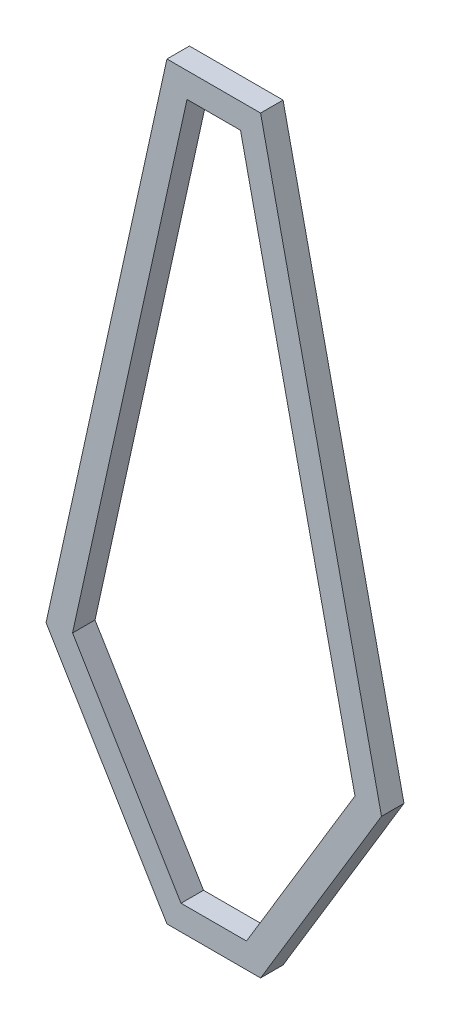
from build123d import *

# Parameters (mm, degrees)
BOSS_EXTRU_1_DEPTH      = 18
ENL_V_MAT_EXTRU_1_DEPTH = 616.122222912


with BuildPart() as part:
    # Esquisse1 → Boss.-Extru.1 (new body)
    with BuildSketch(Plane.XY):
        Polygon((37.5, 0), (-37.5, 0), (-134.355309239, -439.453125), (-37.5, -600), (37.5, -600), (134.355309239, -439.453125), align=None)
    extrude(amount=BOSS_EXTRU_1_DEPTH)

    # Esquisse2 → Enl_v. mat.-Extru.1 (cut, through all)
    with BuildSketch(Plane.XY.offset(18)):
        Polygon((-21.42799274, -20), (-113.105309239, -435.959471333), (-26.208009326, -580), (26.208009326, -580), (113.105309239, -435.959471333), (21.42799274, -20), align=None)
    extrude(amount=-ENL_V_MAT_EXTRU_1_DEPTH, mode=Mode.SUBTRACT)


solid = part.part
